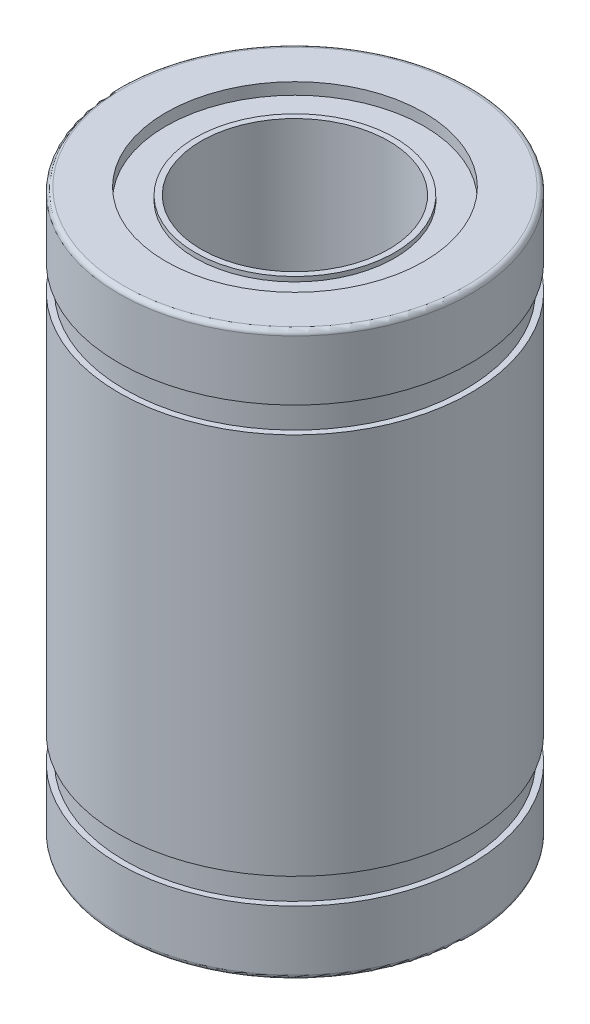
ISO-10303-21;
HEADER;
FILE_DESCRIPTION(('STEP AP214'),'2;1');
FILE_NAME('part.step','',(''),(''),'','','');
FILE_SCHEMA(('AUTOMOTIVE_DESIGN { 1 0 10303 214 1 1 1 1 }'));
ENDSEC;
DATA;
#1=APPLICATION_CONTEXT('core data for automotive mechanical design processes');
#2=APPLICATION_PROTOCOL_DEFINITION('international standard','automotive_design',2000,#1);
#3=PRODUCT_CONTEXT('',#1,'mechanical');
#4=PRODUCT('Part','Part','',(#3));
#5=PRODUCT_RELATED_PRODUCT_CATEGORY('part','',(#4));
#6=PRODUCT_DEFINITION_FORMATION('','',#4);
#7=PRODUCT_DEFINITION_CONTEXT('part definition',#1,'design');
#8=PRODUCT_DEFINITION('design','',#6,#7);
#9=PRODUCT_DEFINITION_SHAPE('','',#8);
#10=(LENGTH_UNIT() NAMED_UNIT(*) SI_UNIT(.MILLI.,.METRE.));
#11=(NAMED_UNIT(*) PLANE_ANGLE_UNIT() SI_UNIT($,.RADIAN.));
#12=(NAMED_UNIT(*) SI_UNIT($,.STERADIAN.) SOLID_ANGLE_UNIT());
#13=UNCERTAINTY_MEASURE_WITH_UNIT(LENGTH_MEASURE(1.E-05),#10,'distance_accuracy_value','');
#14=(GEOMETRIC_REPRESENTATION_CONTEXT(3) GLOBAL_UNCERTAINTY_ASSIGNED_CONTEXT((#13)) GLOBAL_UNIT_ASSIGNED_CONTEXT((#10,
#11,#12)) REPRESENTATION_CONTEXT('',''));
#15=CARTESIAN_POINT('',(0.,0.,0.));
#16=DIRECTION('',(0.,0.,1.));
#17=DIRECTION('',(1.,0.,0.));
#18=AXIS2_PLACEMENT_3D('',#15,#16,#17);
#19=CARTESIAN_POINT('',(0.,0.,0.));
#20=DIRECTION('',(0.,1.,0.));
#21=DIRECTION('',(0.,0.,1.));
#22=AXIS2_PLACEMENT_3D('',#19,#20,#21);
#23=CYLINDRICAL_SURFACE('',#22,4.);
#24=CARTESIAN_POINT('',(0.,0.3,0.));
#25=DIRECTION('',(0.,1.,0.));
#26=DIRECTION('',(0.,0.,1.));
#27=AXIS2_PLACEMENT_3D('',#24,#25,#26);
#28=CIRCLE('',#27,4.);
#29=CARTESIAN_POINT('',(0.,0.3,4.));
#30=VERTEX_POINT('',#29);
#31=EDGE_CURVE('E247',#30,#30,#28,.F.);
#32=ORIENTED_EDGE('',*,*,#31,.T.);
#33=EDGE_LOOP('',(#32));
#34=FACE_BOUND('',#33,.T.);
#35=CARTESIAN_POINT('',(0.,23.7,0.));
#36=DIRECTION('',(0.,1.,0.));
#37=DIRECTION('',(0.,0.,1.));
#38=AXIS2_PLACEMENT_3D('',#35,#36,#37);
#39=CIRCLE('',#38,4.);
#40=CARTESIAN_POINT('',(0.,23.7,4.));
#41=VERTEX_POINT('',#40);
#42=EDGE_CURVE('E244',#41,#41,#39,.F.);
#43=ORIENTED_EDGE('',*,*,#42,.F.);
#44=EDGE_LOOP('',(#43));
#45=FACE_BOUND('',#44,.T.);
#46=ADVANCED_FACE('F17',(#34,#45),#23,.F.);
#47=CARTESIAN_POINT('',(0.,0.3,0.));
#48=DIRECTION('',(0.,1.,0.));
#49=DIRECTION('',(0.,0.,1.));
#50=AXIS2_PLACEMENT_3D('',#47,#48,#49);
#51=PLANE('',#50);
#52=ORIENTED_EDGE('',*,*,#31,.F.);
#53=EDGE_LOOP('',(#52));
#54=FACE_BOUND('',#53,.T.);
#55=CARTESIAN_POINT('',(0.,0.3,0.));
#56=DIRECTION('',(0.,1.,0.));
#57=DIRECTION('',(0.,0.,1.));
#58=AXIS2_PLACEMENT_3D('',#55,#56,#57);
#59=CIRCLE('',#58,4.25);
#60=CARTESIAN_POINT('',(0.,0.3,4.25));
#61=VERTEX_POINT('',#60);
#62=EDGE_CURVE('E241',#61,#61,#59,.T.);
#63=ORIENTED_EDGE('',*,*,#62,.F.);
#64=EDGE_LOOP('',(#63));
#65=FACE_BOUND('',#64,.T.);
#66=ADVANCED_FACE('F155',(#54,#65),#51,.F.);
#67=CARTESIAN_POINT('',(0.,23.7,0.));
#68=DIRECTION('',(0.,1.,0.));
#69=DIRECTION('',(0.,0.,1.));
#70=AXIS2_PLACEMENT_3D('',#67,#68,#69);
#71=PLANE('',#70);
#72=ORIENTED_EDGE('',*,*,#42,.T.);
#73=EDGE_LOOP('',(#72));
#74=FACE_BOUND('',#73,.T.);
#75=CARTESIAN_POINT('',(0.,23.7,0.));
#76=DIRECTION('',(0.,1.,0.));
#77=DIRECTION('',(0.,0.,1.));
#78=AXIS2_PLACEMENT_3D('',#75,#76,#77);
#79=CIRCLE('',#78,4.25);
#80=CARTESIAN_POINT('',(0.,23.7,4.25));
#81=VERTEX_POINT('',#80);
#82=EDGE_CURVE('E238',#81,#81,#79,.F.);
#83=ORIENTED_EDGE('',*,*,#82,.F.);
#84=EDGE_LOOP('',(#83));
#85=FACE_BOUND('',#84,.T.);
#86=ADVANCED_FACE('F152',(#74,#85),#71,.T.);
#87=CARTESIAN_POINT('',(0.,0.5,0.));
#88=DIRECTION('',(0.,1.,0.));
#89=DIRECTION('',(0.,0.,1.));
#90=AXIS2_PLACEMENT_3D('',#87,#88,#89);
#91=CYLINDRICAL_SURFACE('',#90,4.25);
#92=CARTESIAN_POINT('',(0.,0.5,0.));
#93=DIRECTION('',(0.,1.,0.));
#94=DIRECTION('',(0.,0.,1.));
#95=AXIS2_PLACEMENT_3D('',#92,#93,#94);
#96=CIRCLE('',#95,4.25);
#97=CARTESIAN_POINT('',(0.,0.5,4.25));
#98=VERTEX_POINT('',#97);
#99=EDGE_CURVE('E235',#98,#98,#96,.F.);
#100=ORIENTED_EDGE('',*,*,#99,.T.);
#101=EDGE_LOOP('',(#100));
#102=FACE_BOUND('',#101,.T.);
#103=ORIENTED_EDGE('',*,*,#62,.T.);
#104=EDGE_LOOP('',(#103));
#105=FACE_BOUND('',#104,.T.);
#106=ADVANCED_FACE('F148',(#102,#105),#91,.T.);
#107=CARTESIAN_POINT('',(0.,23.5,0.));
#108=DIRECTION('',(0.,1.,0.));
#109=DIRECTION('',(0.,0.,1.));
#110=AXIS2_PLACEMENT_3D('',#107,#108,#109);
#111=CYLINDRICAL_SURFACE('',#110,4.25);
#112=ORIENTED_EDGE('',*,*,#82,.T.);
#113=EDGE_LOOP('',(#112));
#114=FACE_BOUND('',#113,.T.);
#115=CARTESIAN_POINT('',(0.,23.5,0.));
#116=DIRECTION('',(0.,1.,0.));
#117=DIRECTION('',(0.,0.,1.));
#118=AXIS2_PLACEMENT_3D('',#115,#116,#117);
#119=CIRCLE('',#118,4.25);
#120=CARTESIAN_POINT('',(0.,23.5,4.25));
#121=VERTEX_POINT('',#120);
#122=EDGE_CURVE('E232',#121,#121,#119,.F.);
#123=ORIENTED_EDGE('',*,*,#122,.F.);
#124=EDGE_LOOP('',(#123));
#125=FACE_BOUND('',#124,.T.);
#126=ADVANCED_FACE('F144',(#114,#125),#111,.T.);
#127=CARTESIAN_POINT('',(0.,0.5,0.));
#128=DIRECTION('',(0.,1.,0.));
#129=DIRECTION('',(0.,0.,1.));
#130=AXIS2_PLACEMENT_3D('',#127,#128,#129);
#131=PLANE('',#130);
#132=ORIENTED_EDGE('',*,*,#99,.F.);
#133=EDGE_LOOP('',(#132));
#134=FACE_BOUND('',#133,.T.);
#135=CARTESIAN_POINT('',(0.,0.5,0.));
#136=DIRECTION('',(0.,-1.,0.));
#137=DIRECTION('',(0.,0.,-1.));
#138=AXIS2_PLACEMENT_3D('',#135,#136,#137);
#139=CIRCLE('',#138,5.5);
#140=CARTESIAN_POINT('',(0.,0.5,-5.5));
#141=VERTEX_POINT('',#140);
#142=EDGE_CURVE('E229',#141,#141,#139,.T.);
#143=ORIENTED_EDGE('',*,*,#142,.T.);
#144=EDGE_LOOP('',(#143));
#145=FACE_BOUND('',#144,.T.);
#146=ADVANCED_FACE('F140',(#134,#145),#131,.F.);
#147=CARTESIAN_POINT('',(0.,23.5,0.));
#148=DIRECTION('',(0.,1.,0.));
#149=DIRECTION('',(0.,0.,1.));
#150=AXIS2_PLACEMENT_3D('',#147,#148,#149);
#151=PLANE('',#150);
#152=ORIENTED_EDGE('',*,*,#122,.T.);
#153=EDGE_LOOP('',(#152));
#154=FACE_BOUND('',#153,.T.);
#155=CARTESIAN_POINT('',(0.,23.5,0.));
#156=DIRECTION('',(0.,-1.,0.));
#157=DIRECTION('',(0.,0.,-1.));
#158=AXIS2_PLACEMENT_3D('',#155,#156,#157);
#159=CIRCLE('',#158,5.5);
#160=CARTESIAN_POINT('',(0.,23.5,-5.5));
#161=VERTEX_POINT('',#160);
#162=EDGE_CURVE('E226',#161,#161,#159,.F.);
#163=ORIENTED_EDGE('',*,*,#162,.T.);
#164=EDGE_LOOP('',(#163));
#165=FACE_BOUND('',#164,.T.);
#166=ADVANCED_FACE('F136',(#154,#165),#151,.T.);
#167=CARTESIAN_POINT('',(0.,0.,0.));
#168=DIRECTION('',(0.,-1.,0.));
#169=DIRECTION('',(0.,0.,-1.));
#170=AXIS2_PLACEMENT_3D('',#167,#168,#169);
#171=CYLINDRICAL_SURFACE('',#170,5.5);
#172=CARTESIAN_POINT('',(0.,0.,0.));
#173=DIRECTION('',(0.,-1.,0.));
#174=DIRECTION('',(0.,0.,-1.));
#175=AXIS2_PLACEMENT_3D('',#172,#173,#174);
#176=CIRCLE('',#175,5.5);
#177=CARTESIAN_POINT('',(0.,0.,-5.5));
#178=VERTEX_POINT('',#177);
#179=EDGE_CURVE('E223',#178,#178,#176,.T.);
#180=ORIENTED_EDGE('',*,*,#179,.T.);
#181=EDGE_LOOP('',(#180));
#182=FACE_BOUND('',#181,.T.);
#183=ORIENTED_EDGE('',*,*,#142,.F.);
#184=EDGE_LOOP('',(#183));
#185=FACE_BOUND('',#184,.T.);
#186=ADVANCED_FACE('F132',(#182,#185),#171,.F.);
#187=CARTESIAN_POINT('',(0.,24.,0.));
#188=DIRECTION('',(0.,-1.,0.));
#189=DIRECTION('',(0.,0.,-1.));
#190=AXIS2_PLACEMENT_3D('',#187,#188,#189);
#191=CYLINDRICAL_SURFACE('',#190,5.5);
#192=ORIENTED_EDGE('',*,*,#162,.F.);
#193=EDGE_LOOP('',(#192));
#194=FACE_BOUND('',#193,.T.);
#195=CARTESIAN_POINT('',(0.,24.,0.));
#196=DIRECTION('',(0.,-1.,0.));
#197=DIRECTION('',(0.,0.,-1.));
#198=AXIS2_PLACEMENT_3D('',#195,#196,#197);
#199=CIRCLE('',#198,5.5);
#200=CARTESIAN_POINT('',(0.,24.,-5.5));
#201=VERTEX_POINT('',#200);
#202=EDGE_CURVE('E52',#201,#201,#199,.T.);
#203=ORIENTED_EDGE('',*,*,#202,.F.);
#204=EDGE_LOOP('',(#203));
#205=FACE_BOUND('',#204,.T.);
#206=ADVANCED_FACE('F127',(#194,#205),#191,.F.);
#207=CARTESIAN_POINT('',(0.,0.,0.));
#208=DIRECTION('',(0.,1.,0.));
#209=DIRECTION('',(0.,0.,1.));
#210=AXIS2_PLACEMENT_3D('',#207,#208,#209);
#211=PLANE('',#210);
#212=ORIENTED_EDGE('',*,*,#179,.F.);
#213=EDGE_LOOP('',(#212));
#214=FACE_BOUND('',#213,.T.);
#215=CARTESIAN_POINT('',(0.,0.,0.));
#216=DIRECTION('',(0.,1.,0.));
#217=DIRECTION('',(0.,0.,1.));
#218=AXIS2_PLACEMENT_3D('',#215,#216,#217);
#219=CIRCLE('',#218,7.3);
#220=CARTESIAN_POINT('',(0.,0.,7.3));
#221=VERTEX_POINT('',#220);
#222=CARTESIAN_POINT('',(0.,0.,-7.3));
#223=VERTEX_POINT('',#222);
#224=EDGE_CURVE('E50',#221,#223,#219,.T.);
#225=ORIENTED_EDGE('',*,*,#224,.F.);
#226=CARTESIAN_POINT('',(0.,0.,0.));
#227=DIRECTION('',(0.,1.,0.));
#228=DIRECTION('',(0.,0.,-1.));
#229=AXIS2_PLACEMENT_3D('',#226,#227,#228);
#230=CIRCLE('',#229,7.3);
#231=EDGE_CURVE('E45',#223,#221,#230,.T.);
#232=ORIENTED_EDGE('',*,*,#231,.F.);
#233=EDGE_LOOP('',(#225,#232));
#234=FACE_BOUND('',#233,.T.);
#235=ADVANCED_FACE('F49',(#214,#234),#211,.F.);
#236=CARTESIAN_POINT('',(0.,24.,0.));
#237=DIRECTION('',(0.,1.,0.));
#238=DIRECTION('',(0.,0.,1.));
#239=AXIS2_PLACEMENT_3D('',#236,#237,#238);
#240=PLANE('',#239);
#241=ORIENTED_EDGE('',*,*,#202,.T.);
#242=EDGE_LOOP('',(#241));
#243=FACE_BOUND('',#242,.T.);
#244=CARTESIAN_POINT('',(0.,24.,0.));
#245=DIRECTION('',(0.,-1.,0.));
#246=DIRECTION('',(0.,0.,1.));
#247=AXIS2_PLACEMENT_3D('',#244,#245,#246);
#248=CIRCLE('',#247,7.3);
#249=CARTESIAN_POINT('',(0.,24.,7.3));
#250=VERTEX_POINT('',#249);
#251=CARTESIAN_POINT('',(0.,24.,-7.3));
#252=VERTEX_POINT('',#251);
#253=EDGE_CURVE('E36',#250,#252,#248,.T.);
#254=ORIENTED_EDGE('',*,*,#253,.F.);
#255=CARTESIAN_POINT('',(0.,24.,0.));
#256=DIRECTION('',(0.,-1.,0.));
#257=DIRECTION('',(0.,0.,-1.));
#258=AXIS2_PLACEMENT_3D('',#255,#256,#257);
#259=CIRCLE('',#258,7.3);
#260=EDGE_CURVE('E89',#252,#250,#259,.T.);
#261=ORIENTED_EDGE('',*,*,#260,.F.);
#262=EDGE_LOOP('',(#254,#261));
#263=FACE_BOUND('',#262,.T.);
#264=ADVANCED_FACE('F76',(#243,#263),#240,.T.);
#265=CARTESIAN_POINT('',(0.,0.2,0.));
#266=DIRECTION('',(0.,-1.,0.));
#267=DIRECTION('',(0.,0.,-1.));
#268=AXIS2_PLACEMENT_3D('',#265,#266,#267);
#269=TOROIDAL_SURFACE('',#268,7.3,0.2);
#270=ORIENTED_EDGE('',*,*,#231,.T.);
#271=ORIENTED_EDGE('',*,*,#224,.T.);
#272=EDGE_LOOP('',(#270,#271));
#273=FACE_BOUND('',#272,.T.);
#274=CARTESIAN_POINT('',(0.,0.2,0.));
#275=DIRECTION('',(0.,1.,0.));
#276=DIRECTION('',(0.,0.,1.));
#277=AXIS2_PLACEMENT_3D('',#274,#275,#276);
#278=CIRCLE('',#277,7.5);
#279=CARTESIAN_POINT('',(0.,0.2,7.5));
#280=VERTEX_POINT('',#279);
#281=EDGE_CURVE('E86',#280,#280,#278,.T.);
#282=ORIENTED_EDGE('',*,*,#281,.F.);
#283=EDGE_LOOP('',(#282));
#284=FACE_BOUND('',#283,.T.);
#285=ADVANCED_FACE('F56',(#273,#284),#269,.T.);
#286=CARTESIAN_POINT('',(0.,23.8,0.));
#287=DIRECTION('',(0.,1.,0.));
#288=DIRECTION('',(0.,0.,1.));
#289=AXIS2_PLACEMENT_3D('',#286,#287,#288);
#290=TOROIDAL_SURFACE('',#289,7.3,0.2);
#291=ORIENTED_EDGE('',*,*,#253,.T.);
#292=ORIENTED_EDGE('',*,*,#260,.T.);
#293=EDGE_LOOP('',(#291,#292));
#294=FACE_BOUND('',#293,.T.);
#295=CARTESIAN_POINT('',(0.,23.8,0.));
#296=DIRECTION('',(0.,1.,0.));
#297=DIRECTION('',(0.,0.,1.));
#298=AXIS2_PLACEMENT_3D('',#295,#296,#297);
#299=CIRCLE('',#298,7.5);
#300=CARTESIAN_POINT('',(0.,23.8,7.5));
#301=VERTEX_POINT('',#300);
#302=EDGE_CURVE('E88',#301,#301,#299,.F.);
#303=ORIENTED_EDGE('',*,*,#302,.F.);
#304=EDGE_LOOP('',(#303));
#305=FACE_BOUND('',#304,.T.);
#306=ADVANCED_FACE('F75',(#294,#305),#290,.T.);
#307=CARTESIAN_POINT('',(0.,0.,0.));
#308=DIRECTION('',(0.,1.,0.));
#309=DIRECTION('',(0.,0.,1.));
#310=AXIS2_PLACEMENT_3D('',#307,#308,#309);
#311=CYLINDRICAL_SURFACE('',#310,7.5);
#312=CARTESIAN_POINT('',(0.,2.75,0.));
#313=DIRECTION('',(0.,1.,0.));
#314=DIRECTION('',(0.,0.,1.));
#315=AXIS2_PLACEMENT_3D('',#312,#313,#314);
#316=CIRCLE('',#315,7.5);
#317=CARTESIAN_POINT('',(0.,2.75,7.5));
#318=VERTEX_POINT('',#317);
#319=EDGE_CURVE('E210',#318,#318,#316,.T.);
#320=ORIENTED_EDGE('',*,*,#319,.F.);
#321=EDGE_LOOP('',(#320));
#322=FACE_BOUND('',#321,.T.);
#323=ORIENTED_EDGE('',*,*,#281,.T.);
#324=EDGE_LOOP('',(#323));
#325=FACE_BOUND('',#324,.T.);
#326=ADVANCED_FACE('F200',(#322,#325),#311,.T.);
#327=CARTESIAN_POINT('',(0.,0.,0.));
#328=DIRECTION('',(0.,1.,0.));
#329=DIRECTION('',(0.,0.,1.));
#330=AXIS2_PLACEMENT_3D('',#327,#328,#329);
#331=CYLINDRICAL_SURFACE('',#330,7.5);
#332=ORIENTED_EDGE('',*,*,#302,.T.);
#333=EDGE_LOOP('',(#332));
#334=FACE_BOUND('',#333,.T.);
#335=CARTESIAN_POINT('',(0.,21.25,0.));
#336=DIRECTION('',(0.,1.,0.));
#337=DIRECTION('',(0.,0.,1.));
#338=AXIS2_PLACEMENT_3D('',#335,#336,#337);
#339=CIRCLE('',#338,7.5);
#340=CARTESIAN_POINT('',(0.,21.25,7.5));
#341=VERTEX_POINT('',#340);
#342=EDGE_CURVE('E213',#341,#341,#339,.T.);
#343=ORIENTED_EDGE('',*,*,#342,.T.);
#344=EDGE_LOOP('',(#343));
#345=FACE_BOUND('',#344,.T.);
#346=ADVANCED_FACE('F197',(#334,#345),#331,.T.);
#347=CARTESIAN_POINT('',(7.81077606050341,2.75,0.));
#348=DIRECTION('',(0.,1.,0.));
#349=DIRECTION('',(0.,0.,1.));
#350=AXIS2_PLACEMENT_3D('',#347,#348,#349);
#351=PLANE('',#350);
#352=CARTESIAN_POINT('',(0.,2.75,0.));
#353=DIRECTION('',(0.,-1.,0.));
#354=DIRECTION('',(0.,0.,-1.));
#355=AXIS2_PLACEMENT_3D('',#352,#353,#354);
#356=CIRCLE('',#355,7.25);
#357=CARTESIAN_POINT('',(0.,2.75,-7.25));
#358=VERTEX_POINT('',#357);
#359=EDGE_CURVE('E216',#358,#358,#356,.F.);
#360=ORIENTED_EDGE('',*,*,#359,.F.);
#361=EDGE_LOOP('',(#360));
#362=FACE_BOUND('',#361,.T.);
#363=ORIENTED_EDGE('',*,*,#319,.T.);
#364=EDGE_LOOP('',(#363));
#365=FACE_BOUND('',#364,.T.);
#366=ADVANCED_FACE('F193',(#362,#365),#351,.T.);
#367=CARTESIAN_POINT('',(7.81077606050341,21.25,0.));
#368=DIRECTION('',(0.,1.,0.));
#369=DIRECTION('',(0.,0.,1.));
#370=AXIS2_PLACEMENT_3D('',#367,#368,#369);
#371=PLANE('',#370);
#372=CARTESIAN_POINT('',(0.,21.25,0.));
#373=DIRECTION('',(0.,-1.,0.));
#374=DIRECTION('',(0.,0.,-1.));
#375=AXIS2_PLACEMENT_3D('',#372,#373,#374);
#376=CIRCLE('',#375,7.25);
#377=CARTESIAN_POINT('',(0.,21.25,-7.25));
#378=VERTEX_POINT('',#377);
#379=EDGE_CURVE('E483',#378,#378,#376,.T.);
#380=ORIENTED_EDGE('',*,*,#379,.F.);
#381=EDGE_LOOP('',(#380));
#382=FACE_BOUND('',#381,.T.);
#383=ORIENTED_EDGE('',*,*,#342,.F.);
#384=EDGE_LOOP('',(#383));
#385=FACE_BOUND('',#384,.T.);
#386=ADVANCED_FACE('F189',(#382,#385),#371,.F.);
#387=CARTESIAN_POINT('',(0.,3.3,0.));
#388=DIRECTION('',(0.,-1.,0.));
#389=DIRECTION('',(0.,0.,-1.));
#390=AXIS2_PLACEMENT_3D('',#387,#388,#389);
#391=CYLINDRICAL_SURFACE('',#390,7.25);
#392=CARTESIAN_POINT('',(0.,3.85,0.));
#393=DIRECTION('',(0.,-1.,0.));
#394=DIRECTION('',(0.,0.,-1.));
#395=AXIS2_PLACEMENT_3D('',#392,#393,#394);
#396=CIRCLE('',#395,7.25);
#397=CARTESIAN_POINT('',(0.,3.85,-7.25));
#398=VERTEX_POINT('',#397);
#399=EDGE_CURVE('E486',#398,#398,#396,.F.);
#400=ORIENTED_EDGE('',*,*,#399,.F.);
#401=EDGE_LOOP('',(#400));
#402=FACE_BOUND('',#401,.T.);
#403=ORIENTED_EDGE('',*,*,#359,.T.);
#404=EDGE_LOOP('',(#403));
#405=FACE_BOUND('',#404,.T.);
#406=ADVANCED_FACE('F185',(#402,#405),#391,.T.);
#407=CARTESIAN_POINT('',(0.,20.7,0.));
#408=DIRECTION('',(0.,-1.,0.));
#409=DIRECTION('',(0.,0.,-1.));
#410=AXIS2_PLACEMENT_3D('',#407,#408,#409);
#411=CYLINDRICAL_SURFACE('',#410,7.25);
#412=CARTESIAN_POINT('',(0.,20.15,0.));
#413=DIRECTION('',(0.,-1.,0.));
#414=DIRECTION('',(0.,0.,-1.));
#415=AXIS2_PLACEMENT_3D('',#412,#413,#414);
#416=CIRCLE('',#415,7.25);
#417=CARTESIAN_POINT('',(0.,20.15,-7.25));
#418=VERTEX_POINT('',#417);
#419=EDGE_CURVE('E489',#418,#418,#416,.F.);
#420=ORIENTED_EDGE('',*,*,#419,.T.);
#421=EDGE_LOOP('',(#420));
#422=FACE_BOUND('',#421,.T.);
#423=ORIENTED_EDGE('',*,*,#379,.T.);
#424=EDGE_LOOP('',(#423));
#425=FACE_BOUND('',#424,.T.);
#426=ADVANCED_FACE('F181',(#422,#425),#411,.T.);
#427=CARTESIAN_POINT('',(7.25,3.85,0.));
#428=DIRECTION('',(0.,-1.,0.));
#429=DIRECTION('',(0.,0.,-1.));
#430=AXIS2_PLACEMENT_3D('',#427,#428,#429);
#431=PLANE('',#430);
#432=ORIENTED_EDGE('',*,*,#399,.T.);
#433=EDGE_LOOP('',(#432));
#434=FACE_BOUND('',#433,.T.);
#435=CARTESIAN_POINT('',(0.,3.85,0.));
#436=DIRECTION('',(0.,1.,0.));
#437=DIRECTION('',(0.,0.,1.));
#438=AXIS2_PLACEMENT_3D('',#435,#436,#437);
#439=CIRCLE('',#438,7.5);
#440=CARTESIAN_POINT('',(0.,3.85,7.5));
#441=VERTEX_POINT('',#440);
#442=EDGE_CURVE('E28',#441,#441,#439,.T.);
#443=ORIENTED_EDGE('',*,*,#442,.F.);
#444=EDGE_LOOP('',(#443));
#445=FACE_BOUND('',#444,.T.);
#446=ADVANCED_FACE('F174',(#434,#445),#431,.T.);
#447=CARTESIAN_POINT('',(7.25,20.15,0.));
#448=DIRECTION('',(0.,-1.,0.));
#449=DIRECTION('',(0.,0.,-1.));
#450=AXIS2_PLACEMENT_3D('',#447,#448,#449);
#451=PLANE('',#450);
#452=ORIENTED_EDGE('',*,*,#419,.F.);
#453=EDGE_LOOP('',(#452));
#454=FACE_BOUND('',#453,.T.);
#455=CARTESIAN_POINT('',(0.,20.15,0.));
#456=DIRECTION('',(0.,1.,0.));
#457=DIRECTION('',(0.,0.,1.));
#458=AXIS2_PLACEMENT_3D('',#455,#456,#457);
#459=CIRCLE('',#458,7.5);
#460=CARTESIAN_POINT('',(0.,20.15,7.5));
#461=VERTEX_POINT('',#460);
#462=EDGE_CURVE('E11',#461,#461,#459,.F.);
#463=ORIENTED_EDGE('',*,*,#462,.F.);
#464=EDGE_LOOP('',(#463));
#465=FACE_BOUND('',#464,.T.);
#466=ADVANCED_FACE('F168',(#454,#465),#451,.F.);
#467=CARTESIAN_POINT('',(0.,0.,0.));
#468=DIRECTION('',(0.,1.,0.));
#469=DIRECTION('',(0.,0.,1.));
#470=AXIS2_PLACEMENT_3D('',#467,#468,#469);
#471=CYLINDRICAL_SURFACE('',#470,7.5);
#472=ORIENTED_EDGE('',*,*,#462,.T.);
#473=EDGE_LOOP('',(#472));
#474=FACE_BOUND('',#473,.T.);
#475=ORIENTED_EDGE('',*,*,#442,.T.);
#476=EDGE_LOOP('',(#475));
#477=FACE_BOUND('',#476,.T.);
#478=ADVANCED_FACE('F166',(#474,#477),#471,.T.);
#479=CLOSED_SHELL('',(#46,#66,#86,#106,#126,#146,#166,#186,#206,#235,#264,#285,#306,#326,#346,
#366,#386,#406,#426,#446,#466,#478));
#480=MANIFOLD_SOLID_BREP('B1',#479);
#481=ADVANCED_BREP_SHAPE_REPRESENTATION('',(#18,#480),#14);
#482=SHAPE_DEFINITION_REPRESENTATION(#9,#481);
ENDSEC;
END-ISO-10303-21;
